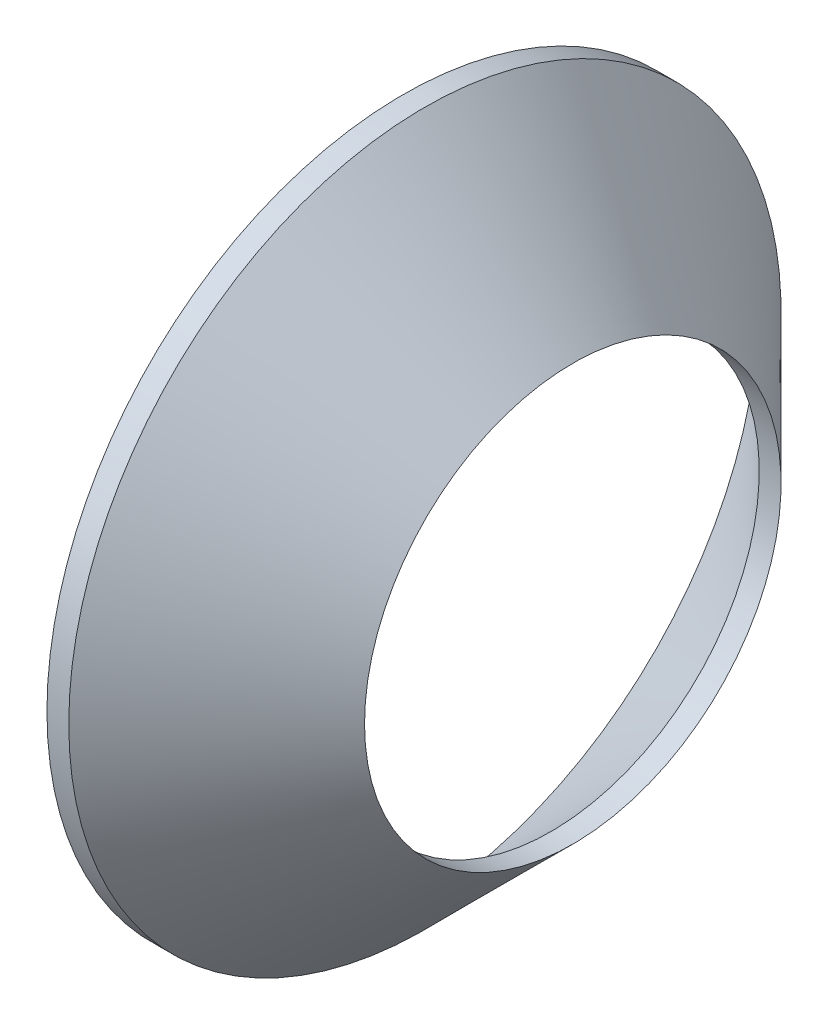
from build123d import *


with BuildPart() as part:
    # Esquisse1 → Base-R_volution (revolve)
    with BuildSketch(Plane.XY, mode=Mode.PRIVATE) as base_r_volution_sk:
        Polygon((0, 11.542893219), (0.707106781, 11.542893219), (5.5, 6.75), (4.792893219, 6.75), align=None)
    revolve(base_r_volution_sk.sketch.rotate(Axis((0, 0, 0), (1, 0, 0)), 90), axis=Axis((0, 0, 0), (1, 0, 0)))


solid = part.part
